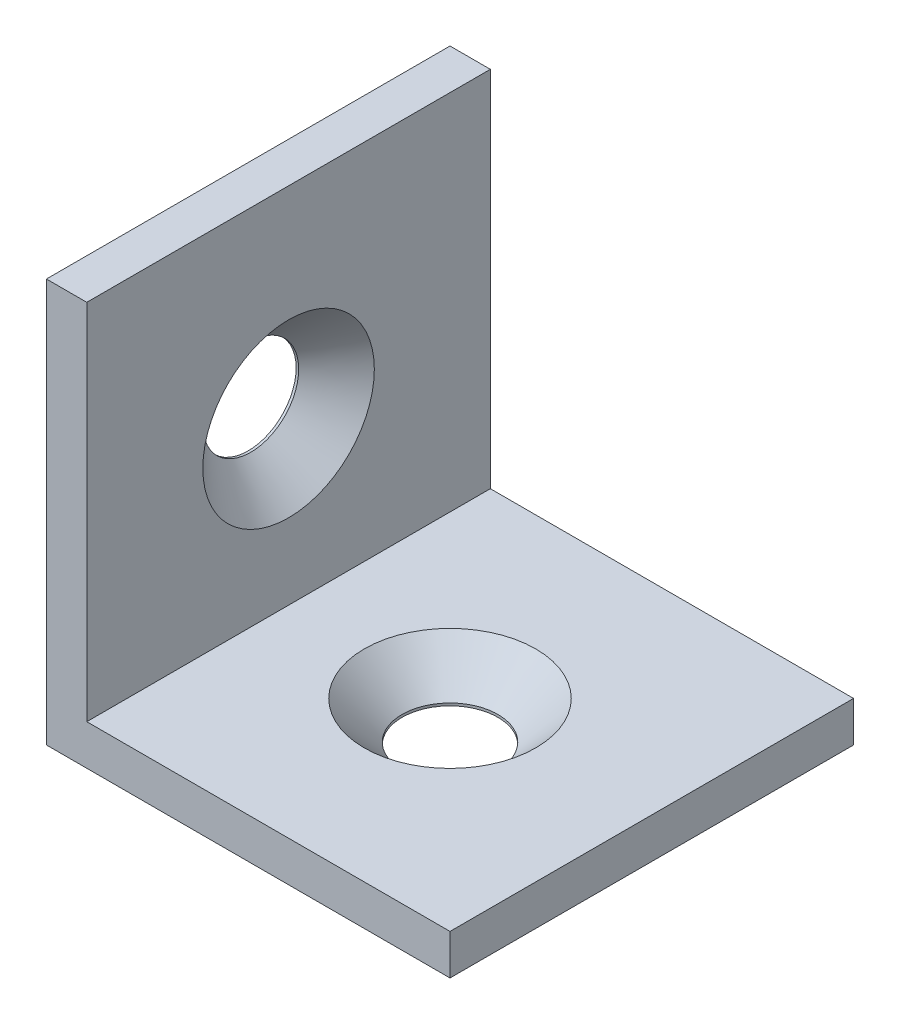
ISO-10303-21;
HEADER;
FILE_DESCRIPTION(('STEP AP214'),'2;1');
FILE_NAME('part.step','',(''),(''),'','','');
FILE_SCHEMA(('AUTOMOTIVE_DESIGN { 1 0 10303 214 1 1 1 1 }'));
ENDSEC;
DATA;
#1=APPLICATION_CONTEXT('core data for automotive mechanical design processes');
#2=APPLICATION_PROTOCOL_DEFINITION('international standard','automotive_design',2000,#1);
#3=PRODUCT_CONTEXT('',#1,'mechanical');
#4=PRODUCT('Part','Part','',(#3));
#5=PRODUCT_RELATED_PRODUCT_CATEGORY('part','',(#4));
#6=PRODUCT_DEFINITION_FORMATION('','',#4);
#7=PRODUCT_DEFINITION_CONTEXT('part definition',#1,'design');
#8=PRODUCT_DEFINITION('design','',#6,#7);
#9=PRODUCT_DEFINITION_SHAPE('','',#8);
#10=(LENGTH_UNIT() NAMED_UNIT(*) SI_UNIT(.MILLI.,.METRE.));
#11=(NAMED_UNIT(*) PLANE_ANGLE_UNIT() SI_UNIT($,.RADIAN.));
#12=(NAMED_UNIT(*) SI_UNIT($,.STERADIAN.) SOLID_ANGLE_UNIT());
#13=UNCERTAINTY_MEASURE_WITH_UNIT(LENGTH_MEASURE(1.E-05),#10,'distance_accuracy_value','');
#14=(GEOMETRIC_REPRESENTATION_CONTEXT(3) GLOBAL_UNCERTAINTY_ASSIGNED_CONTEXT((#13)) GLOBAL_UNIT_ASSIGNED_CONTEXT((#10,
#11,#12)) REPRESENTATION_CONTEXT('',''));
#15=CARTESIAN_POINT('',(0.,0.,0.));
#16=DIRECTION('',(0.,0.,1.));
#17=DIRECTION('',(1.,0.,0.));
#18=AXIS2_PLACEMENT_3D('',#15,#16,#17);
#19=CARTESIAN_POINT('',(0.,40.,40.));
#20=DIRECTION('',(1.,0.,0.));
#21=DIRECTION('',(0.,1.,0.));
#22=AXIS2_PLACEMENT_3D('',#19,#20,#21);
#23=PLANE('',#22);
#24=CARTESIAN_POINT('',(0.,20.,20.));
#25=DIRECTION('',(1.,0.,0.));
#26=DIRECTION('',(0.,0.,-1.));
#27=AXIS2_PLACEMENT_3D('',#24,#25,#26);
#28=CIRCLE('',#27,4.75);
#29=CARTESIAN_POINT('',(0.,20.,15.25));
#30=VERTEX_POINT('',#29);
#31=EDGE_CURVE('E158',#30,#30,#28,.T.);
#32=ORIENTED_EDGE('',*,*,#31,.T.);
#33=EDGE_LOOP('',(#32));
#34=FACE_BOUND('',#33,.T.);
#35=DIRECTION('',(0.,-1.,0.));
#36=VECTOR('',#35,1.);
#37=CARTESIAN_POINT('',(0.,40.,0.));
#38=LINE('',#37,#36);
#39=CARTESIAN_POINT('',(0.,40.,0.));
#40=VERTEX_POINT('',#39);
#41=CARTESIAN_POINT('',(0.,0.,0.));
#42=VERTEX_POINT('',#41);
#43=EDGE_CURVE('E114',#40,#42,#38,.T.);
#44=ORIENTED_EDGE('',*,*,#43,.T.);
#45=DIRECTION('',(0.,0.,-1.));
#46=VECTOR('',#45,1.);
#47=CARTESIAN_POINT('',(0.,0.,40.));
#48=LINE('',#47,#46);
#49=CARTESIAN_POINT('',(0.,0.,40.));
#50=VERTEX_POINT('',#49);
#51=EDGE_CURVE('E11',#50,#42,#48,.T.);
#52=ORIENTED_EDGE('',*,*,#51,.F.);
#53=DIRECTION('',(0.,-1.,0.));
#54=VECTOR('',#53,1.);
#55=CARTESIAN_POINT('',(0.,40.,40.));
#56=LINE('',#55,#54);
#57=CARTESIAN_POINT('',(0.,40.,40.));
#58=VERTEX_POINT('',#57);
#59=EDGE_CURVE('E125',#58,#50,#56,.T.);
#60=ORIENTED_EDGE('',*,*,#59,.F.);
#61=DIRECTION('',(0.,0.,-1.));
#62=VECTOR('',#61,1.);
#63=CARTESIAN_POINT('',(0.,40.,40.));
#64=LINE('',#63,#62);
#65=EDGE_CURVE('E110',#58,#40,#64,.T.);
#66=ORIENTED_EDGE('',*,*,#65,.T.);
#67=EDGE_LOOP('',(#44,#52,#60,#66));
#68=FACE_BOUND('',#67,.T.);
#69=ADVANCED_FACE('F30',(#34,#68),#23,.F.);
#70=CARTESIAN_POINT('',(0.,0.,40.));
#71=DIRECTION('',(0.,1.,0.));
#72=DIRECTION('',(0.,0.,1.));
#73=AXIS2_PLACEMENT_3D('',#70,#71,#72);
#74=PLANE('',#73);
#75=CARTESIAN_POINT('',(20.,0.,20.));
#76=DIRECTION('',(0.,1.,0.));
#77=DIRECTION('',(0.,0.,1.));
#78=AXIS2_PLACEMENT_3D('',#75,#76,#77);
#79=CIRCLE('',#78,4.75);
#80=CARTESIAN_POINT('',(20.,0.,24.75));
#81=VERTEX_POINT('',#80);
#82=EDGE_CURVE('E168',#81,#81,#79,.T.);
#83=ORIENTED_EDGE('',*,*,#82,.T.);
#84=EDGE_LOOP('',(#83));
#85=FACE_BOUND('',#84,.T.);
#86=DIRECTION('',(1.,0.,0.));
#87=VECTOR('',#86,1.);
#88=CARTESIAN_POINT('',(0.,0.,0.));
#89=LINE('',#88,#87);
#90=CARTESIAN_POINT('',(40.,0.,0.));
#91=VERTEX_POINT('',#90);
#92=EDGE_CURVE('E117',#42,#91,#89,.T.);
#93=ORIENTED_EDGE('',*,*,#92,.T.);
#94=DIRECTION('',(0.,0.,-1.));
#95=VECTOR('',#94,1.);
#96=CARTESIAN_POINT('',(40.,0.,40.));
#97=LINE('',#96,#95);
#98=CARTESIAN_POINT('',(40.,0.,40.));
#99=VERTEX_POINT('',#98);
#100=EDGE_CURVE('E38',#99,#91,#97,.T.);
#101=ORIENTED_EDGE('',*,*,#100,.F.);
#102=DIRECTION('',(1.,0.,0.));
#103=VECTOR('',#102,1.);
#104=CARTESIAN_POINT('',(0.,0.,40.));
#105=LINE('',#104,#103);
#106=EDGE_CURVE('E83',#50,#99,#105,.T.);
#107=ORIENTED_EDGE('',*,*,#106,.F.);
#108=ORIENTED_EDGE('',*,*,#51,.T.);
#109=EDGE_LOOP('',(#93,#101,#107,#108));
#110=FACE_BOUND('',#109,.T.);
#111=ADVANCED_FACE('F150',(#85,#110),#74,.F.);
#112=CARTESIAN_POINT('',(40.,0.,40.));
#113=DIRECTION('',(-1.,0.,0.));
#114=DIRECTION('',(0.,0.,1.));
#115=AXIS2_PLACEMENT_3D('',#112,#113,#114);
#116=PLANE('',#115);
#117=DIRECTION('',(0.,1.,0.));
#118=VECTOR('',#117,1.);
#119=CARTESIAN_POINT('',(40.,0.,0.));
#120=LINE('',#119,#118);
#121=CARTESIAN_POINT('',(40.,4.,0.));
#122=VERTEX_POINT('',#121);
#123=EDGE_CURVE('E120',#91,#122,#120,.T.);
#124=ORIENTED_EDGE('',*,*,#123,.T.);
#125=DIRECTION('',(0.,0.,-1.));
#126=VECTOR('',#125,1.);
#127=CARTESIAN_POINT('',(40.,4.,40.));
#128=LINE('',#127,#126);
#129=CARTESIAN_POINT('',(40.,4.,40.));
#130=VERTEX_POINT('',#129);
#131=EDGE_CURVE('E105',#130,#122,#128,.T.);
#132=ORIENTED_EDGE('',*,*,#131,.F.);
#133=DIRECTION('',(0.,1.,0.));
#134=VECTOR('',#133,1.);
#135=CARTESIAN_POINT('',(40.,0.,40.));
#136=LINE('',#135,#134);
#137=EDGE_CURVE('E96',#99,#130,#136,.T.);
#138=ORIENTED_EDGE('',*,*,#137,.F.);
#139=ORIENTED_EDGE('',*,*,#100,.T.);
#140=EDGE_LOOP('',(#124,#132,#138,#139));
#141=FACE_BOUND('',#140,.T.);
#142=ADVANCED_FACE('F131',(#141),#116,.F.);
#143=CARTESIAN_POINT('',(40.,4.,40.));
#144=DIRECTION('',(0.,-1.,0.));
#145=DIRECTION('',(1.,0.,0.));
#146=AXIS2_PLACEMENT_3D('',#143,#144,#145);
#147=PLANE('',#146);
#148=CARTESIAN_POINT('',(20.,4.,20.));
#149=DIRECTION('',(0.,1.,0.));
#150=DIRECTION('',(0.,0.,1.));
#151=AXIS2_PLACEMENT_3D('',#148,#149,#150);
#152=CIRCLE('',#151,8.5);
#153=CARTESIAN_POINT('',(20.,4.,28.5));
#154=VERTEX_POINT('',#153);
#155=EDGE_CURVE('E118',#154,#154,#152,.T.);
#156=ORIENTED_EDGE('',*,*,#155,.F.);
#157=EDGE_LOOP('',(#156));
#158=FACE_BOUND('',#157,.T.);
#159=DIRECTION('',(-1.,0.,0.));
#160=VECTOR('',#159,1.);
#161=CARTESIAN_POINT('',(40.,4.,0.));
#162=LINE('',#161,#160);
#163=CARTESIAN_POINT('',(4.,4.,0.));
#164=VERTEX_POINT('',#163);
#165=EDGE_CURVE('E104',#122,#164,#162,.T.);
#166=ORIENTED_EDGE('',*,*,#165,.T.);
#167=DIRECTION('',(0.,0.,-1.));
#168=VECTOR('',#167,1.);
#169=CARTESIAN_POINT('',(4.,4.,40.));
#170=LINE('',#169,#168);
#171=CARTESIAN_POINT('',(4.,4.,40.));
#172=VERTEX_POINT('',#171);
#173=EDGE_CURVE('E101',#172,#164,#170,.T.);
#174=ORIENTED_EDGE('',*,*,#173,.F.);
#175=DIRECTION('',(-1.,0.,0.));
#176=VECTOR('',#175,1.);
#177=CARTESIAN_POINT('',(40.,4.,40.));
#178=LINE('',#177,#176);
#179=EDGE_CURVE('E90',#130,#172,#178,.T.);
#180=ORIENTED_EDGE('',*,*,#179,.F.);
#181=ORIENTED_EDGE('',*,*,#131,.T.);
#182=EDGE_LOOP('',(#166,#174,#180,#181));
#183=FACE_BOUND('',#182,.T.);
#184=ADVANCED_FACE('F102',(#158,#183),#147,.F.);
#185=CARTESIAN_POINT('',(4.,4.,40.));
#186=DIRECTION('',(-1.,0.,0.));
#187=DIRECTION('',(0.,0.,1.));
#188=AXIS2_PLACEMENT_3D('',#185,#186,#187);
#189=PLANE('',#188);
#190=CARTESIAN_POINT('',(4.,20.,20.));
#191=DIRECTION('',(1.,0.,0.));
#192=DIRECTION('',(0.,0.,-1.));
#193=AXIS2_PLACEMENT_3D('',#190,#191,#192);
#194=CIRCLE('',#193,8.5);
#195=CARTESIAN_POINT('',(4.,20.,11.5));
#196=VERTEX_POINT('',#195);
#197=EDGE_CURVE('E163',#196,#196,#194,.T.);
#198=ORIENTED_EDGE('',*,*,#197,.F.);
#199=EDGE_LOOP('',(#198));
#200=FACE_BOUND('',#199,.T.);
#201=DIRECTION('',(0.,1.,0.));
#202=VECTOR('',#201,1.);
#203=CARTESIAN_POINT('',(4.,4.,0.));
#204=LINE('',#203,#202);
#205=CARTESIAN_POINT('',(4.,40.,0.));
#206=VERTEX_POINT('',#205);
#207=EDGE_CURVE('E69',#164,#206,#204,.T.);
#208=ORIENTED_EDGE('',*,*,#207,.T.);
#209=DIRECTION('',(0.,0.,-1.));
#210=VECTOR('',#209,1.);
#211=CARTESIAN_POINT('',(4.,40.,40.));
#212=LINE('',#211,#210);
#213=CARTESIAN_POINT('',(4.,40.,40.));
#214=VERTEX_POINT('',#213);
#215=EDGE_CURVE('E106',#214,#206,#212,.T.);
#216=ORIENTED_EDGE('',*,*,#215,.F.);
#217=DIRECTION('',(0.,1.,0.));
#218=VECTOR('',#217,1.);
#219=CARTESIAN_POINT('',(4.,4.,40.));
#220=LINE('',#219,#218);
#221=EDGE_CURVE('E94',#172,#214,#220,.T.);
#222=ORIENTED_EDGE('',*,*,#221,.F.);
#223=ORIENTED_EDGE('',*,*,#173,.T.);
#224=EDGE_LOOP('',(#208,#216,#222,#223));
#225=FACE_BOUND('',#224,.T.);
#226=ADVANCED_FACE('F108',(#200,#225),#189,.F.);
#227=CARTESIAN_POINT('',(4.,40.,40.));
#228=DIRECTION('',(0.,-1.,0.));
#229=DIRECTION('',(0.,0.,-1.));
#230=AXIS2_PLACEMENT_3D('',#227,#228,#229);
#231=PLANE('',#230);
#232=DIRECTION('',(-1.,0.,0.));
#233=VECTOR('',#232,1.);
#234=CARTESIAN_POINT('',(4.,40.,0.));
#235=LINE('',#234,#233);
#236=EDGE_CURVE('E75',#206,#40,#235,.T.);
#237=ORIENTED_EDGE('',*,*,#236,.T.);
#238=ORIENTED_EDGE('',*,*,#65,.F.);
#239=DIRECTION('',(-1.,0.,0.));
#240=VECTOR('',#239,1.);
#241=CARTESIAN_POINT('',(4.,40.,40.));
#242=LINE('',#241,#240);
#243=EDGE_CURVE('E46',#214,#58,#242,.T.);
#244=ORIENTED_EDGE('',*,*,#243,.F.);
#245=ORIENTED_EDGE('',*,*,#215,.T.);
#246=EDGE_LOOP('',(#237,#238,#244,#245));
#247=FACE_BOUND('',#246,.T.);
#248=ADVANCED_FACE('F138',(#247),#231,.F.);
#249=CARTESIAN_POINT('',(0.,0.,40.));
#250=DIRECTION('',(0.,0.,1.));
#251=DIRECTION('',(1.,0.,0.));
#252=AXIS2_PLACEMENT_3D('',#249,#250,#251);
#253=PLANE('',#252);
#254=ORIENTED_EDGE('',*,*,#59,.T.);
#255=ORIENTED_EDGE('',*,*,#106,.T.);
#256=ORIENTED_EDGE('',*,*,#137,.T.);
#257=ORIENTED_EDGE('',*,*,#179,.T.);
#258=ORIENTED_EDGE('',*,*,#221,.T.);
#259=ORIENTED_EDGE('',*,*,#243,.T.);
#260=EDGE_LOOP('',(#254,#255,#256,#257,#258,#259));
#261=FACE_BOUND('',#260,.T.);
#262=ADVANCED_FACE('F92',(#261),#253,.T.);
#263=CARTESIAN_POINT('',(0.,0.,0.));
#264=DIRECTION('',(0.,0.,1.));
#265=DIRECTION('',(1.,0.,0.));
#266=AXIS2_PLACEMENT_3D('',#263,#264,#265);
#267=PLANE('',#266);
#268=ORIENTED_EDGE('',*,*,#43,.F.);
#269=ORIENTED_EDGE('',*,*,#236,.F.);
#270=ORIENTED_EDGE('',*,*,#207,.F.);
#271=ORIENTED_EDGE('',*,*,#165,.F.);
#272=ORIENTED_EDGE('',*,*,#123,.F.);
#273=ORIENTED_EDGE('',*,*,#92,.F.);
#274=EDGE_LOOP('',(#268,#269,#270,#271,#272,#273));
#275=FACE_BOUND('',#274,.T.);
#276=ADVANCED_FACE('F134',(#275),#267,.F.);
#277=CARTESIAN_POINT('',(20.,4.,20.));
#278=DIRECTION('',(0.,1.,0.));
#279=DIRECTION('',(0.,0.,1.));
#280=AXIS2_PLACEMENT_3D('',#277,#278,#279);
#281=CONICAL_SURFACE('',#280,8.5,0.785398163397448);
#282=CARTESIAN_POINT('',(20.,0.249999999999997,20.));
#283=DIRECTION('',(0.,1.,0.));
#284=DIRECTION('',(0.,0.,1.));
#285=AXIS2_PLACEMENT_3D('',#282,#283,#284);
#286=CIRCLE('',#285,4.75);
#287=CARTESIAN_POINT('',(20.,0.249999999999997,24.75));
#288=VERTEX_POINT('',#287);
#289=EDGE_CURVE('E171',#288,#288,#286,.T.);
#290=ORIENTED_EDGE('',*,*,#289,.F.);
#291=EDGE_LOOP('',(#290));
#292=FACE_BOUND('',#291,.T.);
#293=ORIENTED_EDGE('',*,*,#155,.T.);
#294=EDGE_LOOP('',(#293));
#295=FACE_BOUND('',#294,.T.);
#296=ADVANCED_FACE('F179',(#292,#295),#281,.F.);
#297=CARTESIAN_POINT('',(20.,4.,20.));
#298=DIRECTION('',(0.,1.,0.));
#299=DIRECTION('',(0.,0.,1.));
#300=AXIS2_PLACEMENT_3D('',#297,#298,#299);
#301=CYLINDRICAL_SURFACE('',#300,4.75);
#302=ORIENTED_EDGE('',*,*,#82,.F.);
#303=EDGE_LOOP('',(#302));
#304=FACE_BOUND('',#303,.T.);
#305=ORIENTED_EDGE('',*,*,#289,.T.);
#306=EDGE_LOOP('',(#305));
#307=FACE_BOUND('',#306,.T.);
#308=ADVANCED_FACE('F216',(#304,#307),#301,.F.);
#309=CARTESIAN_POINT('',(4.,20.,20.));
#310=DIRECTION('',(1.,0.,0.));
#311=DIRECTION('',(0.,0.,-1.));
#312=AXIS2_PLACEMENT_3D('',#309,#310,#311);
#313=CONICAL_SURFACE('',#312,8.5,0.785398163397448);
#314=CARTESIAN_POINT('',(0.249999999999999,20.,20.));
#315=DIRECTION('',(1.,0.,0.));
#316=DIRECTION('',(0.,0.,-1.));
#317=AXIS2_PLACEMENT_3D('',#314,#315,#316);
#318=CIRCLE('',#317,4.75);
#319=CARTESIAN_POINT('',(0.249999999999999,20.,15.25));
#320=VERTEX_POINT('',#319);
#321=EDGE_CURVE('E160',#320,#320,#318,.T.);
#322=ORIENTED_EDGE('',*,*,#321,.F.);
#323=EDGE_LOOP('',(#322));
#324=FACE_BOUND('',#323,.T.);
#325=ORIENTED_EDGE('',*,*,#197,.T.);
#326=EDGE_LOOP('',(#325));
#327=FACE_BOUND('',#326,.T.);
#328=ADVANCED_FACE('F228',(#324,#327),#313,.F.);
#329=CARTESIAN_POINT('',(4.,20.,20.));
#330=DIRECTION('',(1.,0.,0.));
#331=DIRECTION('',(0.,0.,-1.));
#332=AXIS2_PLACEMENT_3D('',#329,#330,#331);
#333=CYLINDRICAL_SURFACE('',#332,4.75);
#334=ORIENTED_EDGE('',*,*,#31,.F.);
#335=EDGE_LOOP('',(#334));
#336=FACE_BOUND('',#335,.T.);
#337=ORIENTED_EDGE('',*,*,#321,.T.);
#338=EDGE_LOOP('',(#337));
#339=FACE_BOUND('',#338,.T.);
#340=ADVANCED_FACE('F238',(#336,#339),#333,.F.);
#341=CLOSED_SHELL('',(#69,#111,#142,#184,#226,#248,#262,#276,#296,#308,#328,#340));
#342=MANIFOLD_SOLID_BREP('B2',#341);
#343=ADVANCED_BREP_SHAPE_REPRESENTATION('',(#18,#342),#14);
#344=SHAPE_DEFINITION_REPRESENTATION(#9,#343);
ENDSEC;
END-ISO-10303-21;
